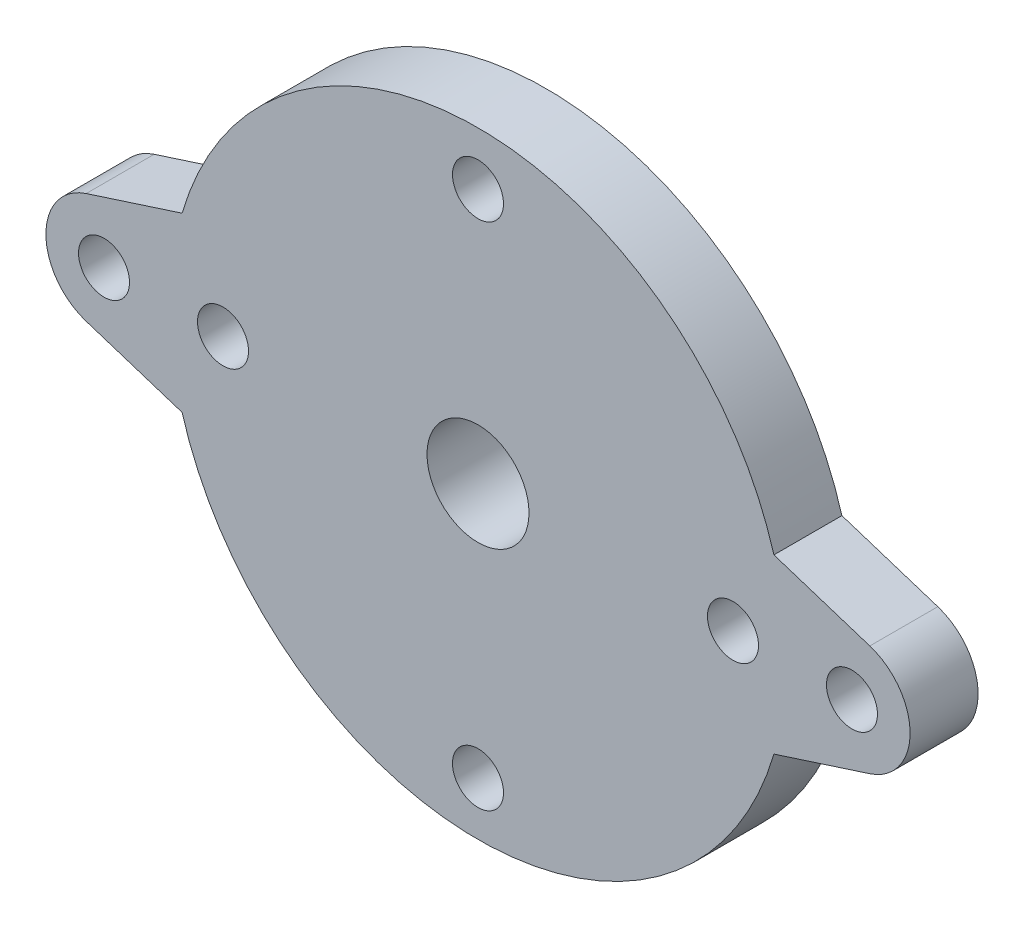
from build123d import *

# Parameters (mm, degrees)
EXTRUDE_1_DEPTH     = 4
SKETCH_2_R          = 1.5
CUT_EXTRUDE_1_DEPTH = 4
SKETCH_3_R          = 8.4
SKETCH_3_R_2        = 8
CUT_EXTRUDE_2_DEPTH = 0.5
EXTRUDE_START       = 2.2
SKETCH_4_R          = 8
EXTRUDE_2_DEPTH     = 2.2
SKETCH_5_R          = 3
CUT_EXTRUDE_3_DEPTH = 20
SKETCH_6_R          = 3
CUT_EXTRUDE_4_DEPTH = 0.2
SKETCH_7_R          = 2
CUT_EXTRUDE_5_DEPTH = 1.5
SKETCH_9_R          = 1.5
CUT_EXTRUDE_6_DEPTH = 3


with BuildPart() as part:
    # Sketch 1 → Extrude 1 (new body)
    with BuildSketch(Plane.XY):
        with BuildLine():
            Line((17.407791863, -5.073663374), (23.049306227, -3.255050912))
            ThreePointArc((23.049306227, -3.255050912), (25.42, 0), (23.049306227, 3.255050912))
            Line((23.049306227, 3.255050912), (17.407791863, 5.073663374))
            ThreePointArc((17.407791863, 5.073663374), (0, 18.132106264), (-17.407791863, 5.073663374))
            Line((-17.407791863, 5.073663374), (-23.049306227, 3.255050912))
            ThreePointArc((-23.049306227, 3.255050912), (-25.42, 0), (-23.049306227, -3.255050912))
            Line((-23.049306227, -3.255050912), (-17.407791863, -5.073663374))
            ThreePointArc((-17.407791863, -5.073663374), (0, -18.132106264), (17.407791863, -5.073663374))
        make_face()
    extrude(amount=EXTRUDE_1_DEPTH)

    # Sketch 2 → Cut-Extrude 1 (cut)
    with BuildSketch(Plane(origin=(0, 0, 0), x_dir=(-1, 0, 0), z_dir=(0, 0, -1))):
        with Locations((-22, 0)):
            Circle(SKETCH_2_R)
        with Locations((22, 0)):
            Circle(SKETCH_2_R)
    extrude(amount=-CUT_EXTRUDE_1_DEPTH, mode=Mode.SUBTRACT)

    # Sketch 3 → Cut-Extrude 2 (cut)
    with BuildSketch(Plane(origin=(0, 0, 0), x_dir=(-1, 0, 0), z_dir=(0, 0, -1))):
        Circle(SKETCH_3_R)
        Circle(SKETCH_3_R_2, mode=Mode.SUBTRACT)
    extrude(amount=-CUT_EXTRUDE_2_DEPTH, mode=Mode.SUBTRACT)

    # Sketch 4 → Extrude 2 (add)
    with BuildSketch(Plane(origin=(0, 0, 0), x_dir=(-1, 0, 0), z_dir=(0, 0, -1)).offset(EXTRUDE_START)):
        Circle(SKETCH_4_R)
    extrude(amount=-EXTRUDE_2_DEPTH)

    # Sketch 5 → Cut-Extrude 3 (cut)
    with BuildSketch(Plane(origin=(0, 0, -2.2), x_dir=(-1, 0, 0), z_dir=(0, 0, -1))):
        Circle(SKETCH_5_R)
    extrude(amount=-CUT_EXTRUDE_3_DEPTH, mode=Mode.SUBTRACT)

    # Sketch 6 → Cut-Extrude 4 (cut)
    with BuildSketch(Plane(origin=(0, 0, 0), x_dir=(-1, 0, 0), z_dir=(0, 0, -1))):
        with Locations((-22, 0)):
            Circle(SKETCH_6_R)
        with Locations((22, 0)):
            Circle(SKETCH_6_R)
    extrude(amount=-CUT_EXTRUDE_4_DEPTH, mode=Mode.SUBTRACT)

    # Sketch 7 → Cut-Extrude 5 (cut)
    with BuildSketch(Plane(origin=(0, 0, 0), x_dir=(-1, 0, 0), z_dir=(0, 0, -1))):
        with Locations((-15, 0)):
            Circle(SKETCH_7_R)
        with Locations((0, 15)):
            Circle(SKETCH_7_R)
        with Locations((15, 0)):
            Circle(SKETCH_7_R)
        with Locations((0, -15)):
            Circle(SKETCH_7_R)
    extrude(amount=-CUT_EXTRUDE_5_DEPTH, mode=Mode.SUBTRACT)

    # Sketch 9 → Cut-Extrude 6 (cut)
    with BuildSketch(Plane(origin=(0, 0, 1.5), x_dir=(-1, 0, 0), z_dir=(0, 0, -1))):
        with Locations((-15, 0)):
            Circle(SKETCH_9_R)
        with Locations((0, 15)):
            Circle(SKETCH_9_R)
        with Locations((15, 0)):
            Circle(SKETCH_9_R)
        with Locations((0, -15)):
            Circle(SKETCH_9_R)
    extrude(amount=-CUT_EXTRUDE_6_DEPTH, mode=Mode.SUBTRACT)


solid = part.part
